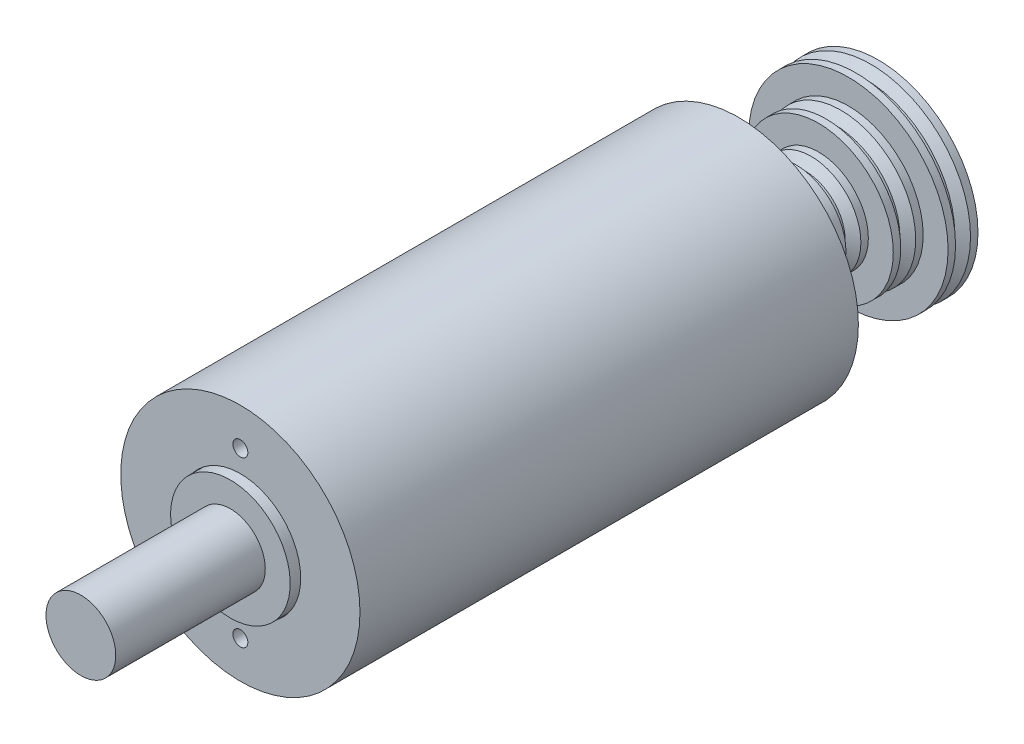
from build123d import *

# Parameters (mm, degrees)
SKETCH5_R            = 20
SKETCH5_R_2          = 8.5
BOSS_EXTRUDE1_DEPTH  = 12
SKETCH6_R            = 20
SKETCH6_R_2          = 8.5
BOSS_EXTRUDE2_DEPTH  = 12
SKETCH7_R            = 12
SKETCH7_R_2          = 9
BOSS_EXTRUDE3_DEPTH  = 2
SKETCH8_R            = 17.5
SKETCH8_R_2          = 8.05
BOSS_EXTRUDE4_DEPTH  = 8
SKETCH32_R           = 1.6
CUT_EXTRUDE9_DEPTH   = 5
SKETCH9_R            = 16
SKETCH9_R_2          = 6
BOSS_EXTRUDE5_DEPTH  = 10
SKETCH11_R           = 15.5
SKETCH11_R_2         = 14
BOSS_EXTRUDE8_DEPTH  = 10
SKETCH12_R           = 16
SKETCH12_R_2         = 6
BOSS_EXTRUDE9_DEPTH  = 10
SKETCH13_R           = 8
SKETCH13_R_2         = 6.5
BOSS_EXTRUDE10_DEPTH = 2
BOSS_EXTRUDE11_START = 8
SKETCH14_R           = 12
SKETCH14_R_2         = 5.55
BOSS_EXTRUDE11_DEPTH = 8
SKETCH33_R           = 1.6
CUT_EXTRUDE10_DEPTH  = 5
SKETCH15_R           = 24
BOSS_EXTRUDE12_DEPTH = 50
SKETCH16_R           = 16
CUT_EXTRUDE1_DEPTH   = 100
SKETCH17_R           = 21
SKETCH17_R_2         = 16
CUT_EXTRUDE2_DEPTH   = 11
SKETCH18_R           = 20
SKETCH18_R_2         = 16
CUT_EXTRUDE3_DEPTH   = 34
SKETCH19_R           = 18
SKETCH19_R_2         = 16
CUT_EXTRUDE4_DEPTH   = 14
SKETCH20_R           = 21
SKETCH20_R_2         = 20
CUT_EXTRUDE5_DEPTH   = 10
SKETCH21_R           = 21
SKETCH21_R_2         = 12.1
BOSS_EXTRUDE13_DEPTH = 10
SKETCH22_R           = 1.5
CUT_EXTRUDE6_DEPTH   = 5
SKETCH23_R           = 21
SKETCH23_R_2         = 12.1
BOSS_EXTRUDE14_DEPTH = 10
SKETCH24_R           = 2.5
CUT_EXTRUDE7_DEPTH   = 5
SKETCH29_R           = 21
SKETCH29_R_2         = 19.8
SKETCH29_R_3         = 17.5
SKETCH29_R_4         = 12.1
CUT_EXTRUDE8_DEPTH   = 1
SKETCH30_R           = 15.75
SKETCH30_R_2         = 14.1
BOSS_EXTRUDE15_DEPTH = 1


with BuildPart() as part:
    # Sketch1 → Revolve2 (revolve)
    with BuildSketch(Plane(origin=(0, 0, 0), x_dir=(0, 0, -1), z_dir=(1, 0, 0)), mode=Mode.PRIVATE) as revolve2_sk:
        Polygon((-82, 0), (-82, 7), (-52, 7), (-52, 12), (-48, 12), (-48, 7.4), (-44, 7.4), (-44, 11), (-40, 11), (-40, 8.5), (-16, 8.5), (-16, 7.5), (-14, 7.5), (-14, 8.45), (-1, 8.45), (-1, 7.4), (9, 7.4), (9, 6), (39, 6), (39, 5), (41, 5), (41, 5.95), (53, 5.95), (53, 5), (78, 5), (78, 0), align=None)
    revolve(revolve2_sk.sketch.rotate(Axis((0, 0, 126.394277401), (0, 0, -1)), 180), axis=Axis((0, 0, 126.394277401), (0, 0, -1)))


with BuildPart() as body_2:
    # Sketch5 → Boss-Extrude1 (new body)
    with BuildSketch(Plane(origin=(0, 0, 40), x_dir=(-1, 0, 0), z_dir=(0, 0, -1))):
        with Locations(Location((0, 0, 0), (0, 0, 90))):
            Circle(SKETCH5_R)
        with Locations(Location((0, 0, 0), (0, 0, 90))):
            Circle(SKETCH5_R_2, mode=Mode.SUBTRACT)
    extrude(amount=BOSS_EXTRUDE1_DEPTH)


with BuildPart() as body_3:
    # Sketch6 → Boss-Extrude2 (new body)
    with BuildSketch(Plane(origin=(0, 0, 28), x_dir=(-1, 0, 0), z_dir=(0, 0, -1))):
        with Locations(Location((0, 0, 0), (0, 0, 90))):
            Circle(SKETCH6_R)
        with Locations(Location((0, 0, 0), (0, 0, 90))):
            Circle(SKETCH6_R_2, mode=Mode.SUBTRACT)
    extrude(amount=BOSS_EXTRUDE2_DEPTH)


with BuildPart() as body_4:
    # Sketch7 → Boss-Extrude3 (new body)
    with BuildSketch(Plane(origin=(0, 0, 16), x_dir=(-1, 0, 0), z_dir=(0, 0, -1))):
        with Locations(Location((0, 0, 0), (0, 0, 90))):
            Circle(SKETCH7_R)
        with Locations(Location((0, 0, 0), (0, 0, 90))):
            Circle(SKETCH7_R_2, mode=Mode.SUBTRACT)
    extrude(amount=BOSS_EXTRUDE3_DEPTH)

    # Sketch8 → Boss-Extrude4 (add)
    with BuildSketch(Plane(origin=(0, 0, 14), x_dir=(-1, 0, 0), z_dir=(0, 0, -1))):
        with Locations(Location((0, 0, 0), (0, 0, 90))):
            Circle(SKETCH8_R)
        with Locations(Location((0, 0, 0), (0, 0, 90))):
            Circle(SKETCH8_R_2, mode=Mode.SUBTRACT)
    extrude(amount=BOSS_EXTRUDE4_DEPTH)

    # Sketch32 → Cut-Extrude9 (cut)
    with BuildSketch(Plane(origin=(0, 0, 6), x_dir=(-1, 0, 0), z_dir=(0, 0, -1))):
        with Locations(Location((0, -13, 0), (0, 0, 90))):
            Circle(SKETCH32_R)
        with Locations(Location((0, 13, 0), (0, 0, 90))):
            Circle(SKETCH32_R)
    extrude(amount=-CUT_EXTRUDE9_DEPTH, mode=Mode.SUBTRACT)


with BuildPart() as body_5:
    # Sketch9 → Boss-Extrude5 (new body)
    with BuildSketch(Plane(origin=(0, 0, -9), x_dir=(-1, 0, 0), z_dir=(0, 0, -1))):
        with Locations(Location((0, 0, 0), (0, 0, 90))):
            Circle(SKETCH9_R)
        with Locations(Location((0, 0, 0), (0, 0, 90))):
            Circle(SKETCH9_R_2, mode=Mode.SUBTRACT)
    extrude(amount=BOSS_EXTRUDE5_DEPTH)


with BuildPart() as body_6:
    # Sketch11 → Boss-Extrude8 (new body)
    with BuildSketch(Plane(origin=(0, 0, -19), x_dir=(-1, 0, 0), z_dir=(0, 0, -1))):
        with Locations(Location((0, 0, 0), (0, 0, 90))):
            Circle(SKETCH11_R)
        with Locations(Location((0, 0, 0), (0, 0, 90))):
            Circle(SKETCH11_R_2, mode=Mode.SUBTRACT)
    extrude(amount=BOSS_EXTRUDE8_DEPTH)


with BuildPart() as body_7:
    # Sketch12 → Boss-Extrude9 (new body)
    with BuildSketch(Plane(origin=(0, 0, -29), x_dir=(-1, 0, 0), z_dir=(0, 0, -1))):
        with Locations(Location((0, 0, 0), (0, 0, 90))):
            Circle(SKETCH12_R)
        with Locations(Location((0, 0, 0), (0, 0, 90))):
            Circle(SKETCH12_R_2, mode=Mode.SUBTRACT)
    extrude(amount=BOSS_EXTRUDE9_DEPTH)


with BuildPart() as body_8:
    # Sketch13 → Boss-Extrude10 (new body)
    with BuildSketch(Plane(origin=(0, 0, -39), x_dir=(-1, 0, 0), z_dir=(0, 0, -1))):
        with Locations(Location((0, 0, 0), (0, 0, 90))):
            Circle(SKETCH13_R)
        with Locations(Location((0, 0, 0), (0, 0, 90))):
            Circle(SKETCH13_R_2, mode=Mode.SUBTRACT)
    extrude(amount=BOSS_EXTRUDE10_DEPTH)

    # Sketch14 → Boss-Extrude11 (add)
    with BuildSketch(Plane(origin=(0, 0, -41), x_dir=(-1, 0, 0), z_dir=(0, 0, -1)).offset(BOSS_EXTRUDE11_START)):
        with Locations(Location((0, 0, 0), (0, 0, 90))):
            Circle(SKETCH14_R)
        with Locations(Location((0, 0, 0), (0, 0, 90))):
            Circle(SKETCH14_R_2, mode=Mode.SUBTRACT)
    extrude(amount=-BOSS_EXTRUDE11_DEPTH)

    # Sketch33 → Cut-Extrude10 (cut)
    with BuildSketch(Plane(origin=(0, 0, -49), x_dir=(-1, 0, 0), z_dir=(0, 0, -1))):
        with Locations(Location((0, -8.75, 0), (0, 0, 90))):
            Circle(SKETCH33_R)
        with Locations(Location((0, 8.75, 0), (0, 0, 90))):
            Circle(SKETCH33_R)
    extrude(amount=-CUT_EXTRUDE10_DEPTH, mode=Mode.SUBTRACT)


with BuildPart() as body_9:
    # Sketch15 → Boss-Extrude12 (new, symmetric)
    with BuildSketch(Plane.XY):
        Circle(SKETCH15_R)
    extrude(amount=BOSS_EXTRUDE12_DEPTH, both=True)

    # Sketch16 → Cut-Extrude1 (cut)
    with BuildSketch(Plane(origin=(0, 0, -50), x_dir=(-1, 0, 0), z_dir=(0, 0, -1))):
        with Locations(Location((0, 0, 0), (0, 0, 90))):
            Circle(SKETCH16_R)
    extrude(amount=-CUT_EXTRUDE1_DEPTH, mode=Mode.SUBTRACT)

    # Sketch17 → Cut-Extrude2 (cut)
    with BuildSketch(Plane(origin=(0, 0, -50), x_dir=(-1, 0, 0), z_dir=(0, 0, -1))):
        Circle(SKETCH17_R)
        with Locations(Location((0, 0, 0), (0, 0, 90))):
            Circle(SKETCH17_R_2, mode=Mode.SUBTRACT)
    extrude(amount=-CUT_EXTRUDE2_DEPTH, mode=Mode.SUBTRACT)

    # Sketch18 → Cut-Extrude3 (cut)
    with BuildSketch(Plane.XY.offset(50)):
        with Locations(Location((0, 0, 0), (0, 0, 90))):
            Circle(SKETCH18_R)
        with Locations(Location((0, 0, 0), (0, 0, 90))):
            Circle(SKETCH18_R_2, mode=Mode.SUBTRACT)
    extrude(amount=-CUT_EXTRUDE3_DEPTH, mode=Mode.SUBTRACT)

    # Sketch19 → Cut-Extrude4 (cut)
    with BuildSketch(Plane.XY.offset(16)):
        Circle(SKETCH19_R)
        with Locations(Location((0, 0, 0), (0, 0, 90))):
            Circle(SKETCH19_R_2, mode=Mode.SUBTRACT)
    extrude(amount=-CUT_EXTRUDE4_DEPTH, mode=Mode.SUBTRACT)

    # Sketch20 → Cut-Extrude5 (cut)
    with BuildSketch(Plane.XY.offset(50)):
        with Locations(Location((0, 0, 0), (0, 0, 180))):
            Circle(SKETCH20_R)
        with Locations(Location((0, 0, 0), (0, 0, 90))):
            Circle(SKETCH20_R_2, mode=Mode.SUBTRACT)
    extrude(amount=-CUT_EXTRUDE5_DEPTH, mode=Mode.SUBTRACT)


with BuildPart() as body_10:
    # Sketch21 → Boss-Extrude13 (new body)
    with BuildSketch(Plane.XY.offset(50)):
        with Locations(Location((0, 0, 0), (0, 0, 180))):
            Circle(SKETCH21_R)
        Circle(SKETCH21_R_2, mode=Mode.SUBTRACT)
    extrude(amount=-BOSS_EXTRUDE13_DEPTH)

    # Sketch22 → Cut-Extrude6 (cut)
    with BuildSketch(Plane.XY.offset(50)):
        with Locations((0, -16.5)):
            Circle(SKETCH22_R)
        with Locations((0, 16.5)):
            Circle(SKETCH22_R)
    extrude(amount=-CUT_EXTRUDE6_DEPTH, mode=Mode.SUBTRACT)

    # Sketch29 → Cut-Extrude8 (cut)
    # profile 1 of 2: a face of its own
    with BuildSketch(Plane(origin=(0, 0, 40), x_dir=(-1, 0, 0), z_dir=(0, 0, -1))):
        Circle(SKETCH29_R)
        Circle(SKETCH29_R_2, mode=Mode.SUBTRACT)
    # profile 2 of 2: a face of its own
    with BuildSketch(Plane(origin=(0, 0, 40), x_dir=(-1, 0, 0), z_dir=(0, 0, -1))):
        with Locations(Location((0, 0, 0), (0, 0, 90))):
            Circle(SKETCH29_R_3)
        with Locations(Location((0, 0, 0), (0, 0, 180))):
            Circle(SKETCH29_R_4, mode=Mode.SUBTRACT)
    extrude(amount=-CUT_EXTRUDE8_DEPTH, mode=Mode.SUBTRACT)


with BuildPart() as body_11:
    # Sketch23 → Boss-Extrude14 (new body)
    with BuildSketch(Plane(origin=(0, 0, -50), x_dir=(-1, 0, 0), z_dir=(0, 0, -1))):
        Circle(SKETCH23_R)
        with Locations(Location((0, 0, 0), (0, 0, 180))):
            Circle(SKETCH23_R_2, mode=Mode.SUBTRACT)
    extrude(amount=-BOSS_EXTRUDE14_DEPTH)

    # Sketch24 → Cut-Extrude7 (cut)
    with BuildSketch(Plane(origin=(0, 0, -50), x_dir=(-1, 0, 0), z_dir=(0, 0, -1))):
        with Locations((16.5, 0)):
            Circle(SKETCH24_R)
        with Locations((-16.5, 0)):
            Circle(SKETCH24_R)
    extrude(amount=-CUT_EXTRUDE7_DEPTH, mode=Mode.SUBTRACT)

    # Sketch30 → Boss-Extrude15 (add)
    with BuildSketch(Plane.XY.offset(-40)):
        with Locations(Location((0, 0, 0), (0, 0, 180))):
            Circle(SKETCH30_R)
        with Locations(Location((0, 0, 0), (0, 0, 90))):
            Circle(SKETCH30_R_2, mode=Mode.SUBTRACT)
    extrude(amount=BOSS_EXTRUDE15_DEPTH)


with BuildPart() as body_12:
    # Sketch26 → Revolve4 (revolve)
    with BuildSketch(Plane(origin=(0, 0, 0), x_dir=(0, 0, -1), z_dir=(1, 0, 0)), mode=Mode.PRIVATE) as revolve4_sk:
        Polygon((72, 15), (70.5, 15), (69.345299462, 13), (68.654700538, 13), (67.5, 15), (66, 15), (66, 10), (64.5, 10), (63.345299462, 8), (62.654700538, 8), (61.5, 10), (54.5, 10), (54.5, 5), (78, 5), (78, 20), (76.5, 20), (75.345299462, 18), (74.654700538, 18), (73.5, 20), (72, 20), align=None)
    revolve(revolve4_sk.sketch.rotate(Axis((0, 0, -50.567893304), (0, 0, -1)), 90), axis=Axis((0, 0, -50.567893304), (0, 0, -1)))


with BuildPart() as part_1:
    add(part.part)

    # Combine1: union body 11, body 10, body 9, body 8, body 7, body 6, body 5, body 4, body 3, body 2, body 12
    add(body_11.part)
    add(body_10.part)
    add(body_9.part)
    add(body_8.part)
    add(body_7.part)
    add(body_6.part)
    add(body_5.part)
    add(body_4.part)
    add(body_3.part)
    add(body_2.part)
    add(body_12.part)


solid = part_1.part
